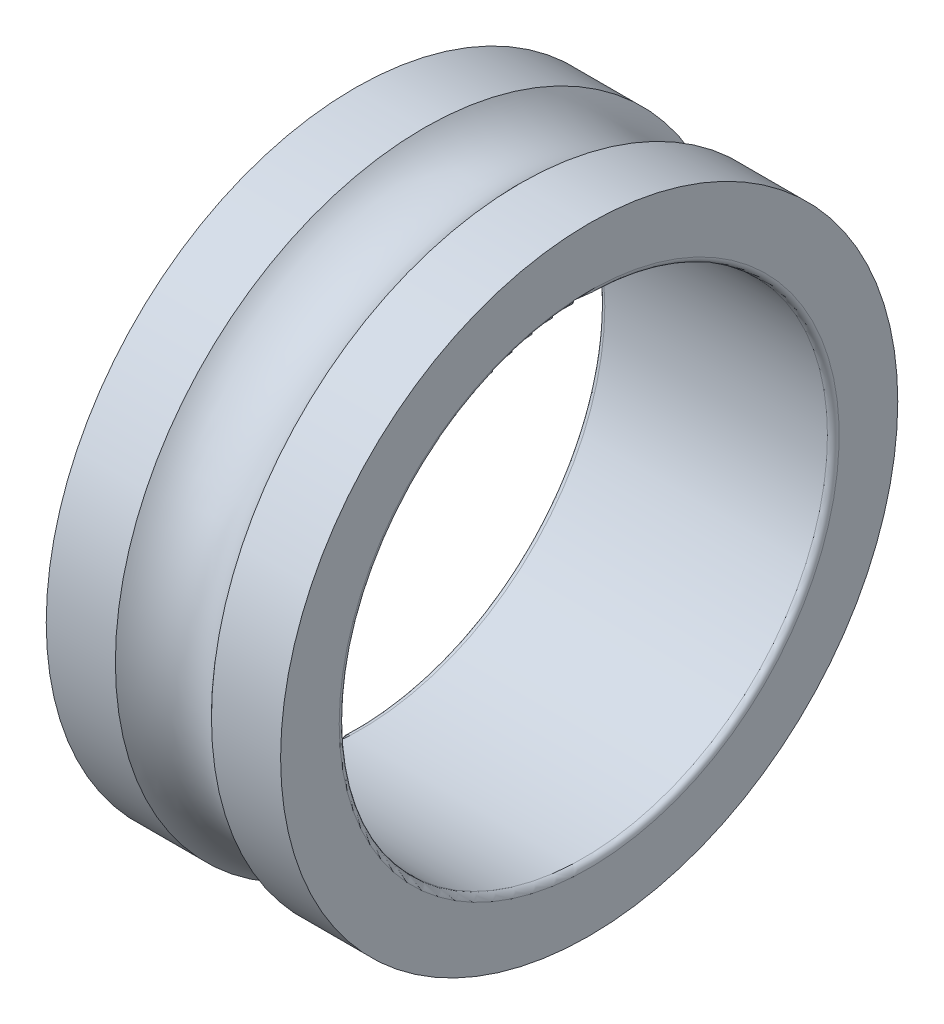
ISO-10303-21;
HEADER;
FILE_DESCRIPTION(('STEP AP214'),'2;1');
FILE_NAME('part.step','',(''),(''),'','','');
FILE_SCHEMA(('AUTOMOTIVE_DESIGN { 1 0 10303 214 1 1 1 1 }'));
ENDSEC;
DATA;
#1=APPLICATION_CONTEXT('core data for automotive mechanical design processes');
#2=APPLICATION_PROTOCOL_DEFINITION('international standard','automotive_design',2000,#1);
#3=PRODUCT_CONTEXT('',#1,'mechanical');
#4=PRODUCT('Part','Part','',(#3));
#5=PRODUCT_RELATED_PRODUCT_CATEGORY('part','',(#4));
#6=PRODUCT_DEFINITION_FORMATION('','',#4);
#7=PRODUCT_DEFINITION_CONTEXT('part definition',#1,'design');
#8=PRODUCT_DEFINITION('design','',#6,#7);
#9=PRODUCT_DEFINITION_SHAPE('','',#8);
#10=(LENGTH_UNIT() NAMED_UNIT(*) SI_UNIT(.MILLI.,.METRE.));
#11=(NAMED_UNIT(*) PLANE_ANGLE_UNIT() SI_UNIT($,.RADIAN.));
#12=(NAMED_UNIT(*) SI_UNIT($,.STERADIAN.) SOLID_ANGLE_UNIT());
#13=UNCERTAINTY_MEASURE_WITH_UNIT(LENGTH_MEASURE(1.E-05),#10,'distance_accuracy_value','');
#14=(GEOMETRIC_REPRESENTATION_CONTEXT(3) GLOBAL_UNCERTAINTY_ASSIGNED_CONTEXT((#13)) GLOBAL_UNIT_ASSIGNED_CONTEXT((#10,
#11,#12)) REPRESENTATION_CONTEXT('',''));
#15=CARTESIAN_POINT('',(0.,0.,0.));
#16=DIRECTION('',(0.,0.,1.));
#17=DIRECTION('',(1.,0.,0.));
#18=AXIS2_PLACEMENT_3D('',#15,#16,#17);
#19=CARTESIAN_POINT('',(0.300000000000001,0.,0.));
#20=DIRECTION('',(-1.,0.,0.));
#21=DIRECTION('',(0.,0.,1.));
#22=AXIS2_PLACEMENT_3D('',#19,#20,#21);
#23=TOROIDAL_SURFACE('',#22,12.8,0.3);
#24=CARTESIAN_POINT('',(0.300000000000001,0.,0.));
#25=DIRECTION('',(-1.,0.,0.));
#26=DIRECTION('',(0.,0.,1.));
#27=AXIS2_PLACEMENT_3D('',#24,#25,#26);
#28=CIRCLE('',#27,12.5);
#29=CARTESIAN_POINT('',(0.300000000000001,0.,12.5));
#30=VERTEX_POINT('',#29);
#31=EDGE_CURVE('E10',#30,#30,#28,.T.);
#32=ORIENTED_EDGE('',*,*,#31,.F.);
#33=EDGE_LOOP('',(#32));
#34=FACE_BOUND('',#33,.T.);
#35=CARTESIAN_POINT('',(0.,0.,0.));
#36=DIRECTION('',(-1.,0.,0.));
#37=DIRECTION('',(0.,0.,1.));
#38=AXIS2_PLACEMENT_3D('',#35,#36,#37);
#39=CIRCLE('',#38,12.8);
#40=CARTESIAN_POINT('',(0.,0.,12.8));
#41=VERTEX_POINT('',#40);
#42=EDGE_CURVE('E62',#41,#41,#39,.T.);
#43=ORIENTED_EDGE('',*,*,#42,.T.);
#44=EDGE_LOOP('',(#43));
#45=FACE_BOUND('',#44,.T.);
#46=ADVANCED_FACE('F34',(#34,#45),#23,.T.);
#47=CARTESIAN_POINT('',(0.,0.,0.));
#48=DIRECTION('',(-1.,0.,0.));
#49=DIRECTION('',(0.,0.,1.));
#50=AXIS2_PLACEMENT_3D('',#47,#48,#49);
#51=CYLINDRICAL_SURFACE('',#50,12.5);
#52=CARTESIAN_POINT('',(11.7,0.,0.));
#53=DIRECTION('',(-1.,0.,0.));
#54=DIRECTION('',(0.,0.,1.));
#55=AXIS2_PLACEMENT_3D('',#52,#53,#54);
#56=CIRCLE('',#55,12.5);
#57=CARTESIAN_POINT('',(11.7,0.,12.5));
#58=VERTEX_POINT('',#57);
#59=EDGE_CURVE('E40',#58,#58,#56,.T.);
#60=ORIENTED_EDGE('',*,*,#59,.F.);
#61=EDGE_LOOP('',(#60));
#62=FACE_BOUND('',#61,.T.);
#63=ORIENTED_EDGE('',*,*,#31,.T.);
#64=EDGE_LOOP('',(#63));
#65=FACE_BOUND('',#64,.T.);
#66=ADVANCED_FACE('F99',(#62,#65),#51,.F.);
#67=CARTESIAN_POINT('',(11.7,0.,0.));
#68=DIRECTION('',(-1.,0.,0.));
#69=DIRECTION('',(0.,0.,1.));
#70=AXIS2_PLACEMENT_3D('',#67,#68,#69);
#71=TOROIDAL_SURFACE('',#70,12.8,0.300000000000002);
#72=CARTESIAN_POINT('',(12.,0.,0.));
#73=DIRECTION('',(-1.,0.,0.));
#74=DIRECTION('',(0.,0.,1.));
#75=AXIS2_PLACEMENT_3D('',#72,#73,#74);
#76=CIRCLE('',#75,12.8);
#77=CARTESIAN_POINT('',(12.,0.,12.8));
#78=VERTEX_POINT('',#77);
#79=EDGE_CURVE('E44',#78,#78,#76,.T.);
#80=ORIENTED_EDGE('',*,*,#79,.F.);
#81=EDGE_LOOP('',(#80));
#82=FACE_BOUND('',#81,.T.);
#83=ORIENTED_EDGE('',*,*,#59,.T.);
#84=EDGE_LOOP('',(#83));
#85=FACE_BOUND('',#84,.T.);
#86=ADVANCED_FACE('F94',(#82,#85),#71,.T.);
#87=CARTESIAN_POINT('',(12.,0.,-15.8));
#88=DIRECTION('',(-1.,0.,0.));
#89=DIRECTION('',(0.,0.,1.));
#90=AXIS2_PLACEMENT_3D('',#87,#88,#89);
#91=PLANE('',#90);
#92=CARTESIAN_POINT('',(12.,0.,0.));
#93=DIRECTION('',(-1.,0.,0.));
#94=DIRECTION('',(0.,0.,1.));
#95=AXIS2_PLACEMENT_3D('',#92,#93,#94);
#96=CIRCLE('',#95,15.8);
#97=CARTESIAN_POINT('',(12.,0.,15.8));
#98=VERTEX_POINT('',#97);
#99=EDGE_CURVE('E48',#98,#98,#96,.T.);
#100=ORIENTED_EDGE('',*,*,#99,.F.);
#101=EDGE_LOOP('',(#100));
#102=FACE_BOUND('',#101,.T.);
#103=ORIENTED_EDGE('',*,*,#79,.T.);
#104=EDGE_LOOP('',(#103));
#105=FACE_BOUND('',#104,.T.);
#106=ADVANCED_FACE('F88',(#102,#105),#91,.F.);
#107=CARTESIAN_POINT('',(0.,0.,0.));
#108=DIRECTION('',(-1.,0.,0.));
#109=DIRECTION('',(0.,0.,1.));
#110=AXIS2_PLACEMENT_3D('',#107,#108,#109);
#111=CYLINDRICAL_SURFACE('',#110,15.8);
#112=CARTESIAN_POINT('',(8.45967477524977,0.,0.));
#113=DIRECTION('',(-1.,0.,0.));
#114=DIRECTION('',(0.,0.,1.));
#115=AXIS2_PLACEMENT_3D('',#112,#113,#114);
#116=CIRCLE('',#115,15.8);
#117=CARTESIAN_POINT('',(8.45967477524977,0.,15.8));
#118=VERTEX_POINT('',#117);
#119=EDGE_CURVE('E53',#118,#118,#116,.T.);
#120=ORIENTED_EDGE('',*,*,#119,.F.);
#121=EDGE_LOOP('',(#120));
#122=FACE_BOUND('',#121,.T.);
#123=ORIENTED_EDGE('',*,*,#99,.T.);
#124=EDGE_LOOP('',(#123));
#125=FACE_BOUND('',#124,.T.);
#126=ADVANCED_FACE('F82',(#122,#125),#111,.T.);
#127=CARTESIAN_POINT('',(6.,0.,0.));
#128=DIRECTION('',(-1.,0.,0.));
#129=DIRECTION('',(0.,0.,1.));
#130=AXIS2_PLACEMENT_3D('',#127,#128,#129);
#131=TOROIDAL_SURFACE('',#130,18.,3.3);
#132=CARTESIAN_POINT('',(3.54032522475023,0.,0.));
#133=DIRECTION('',(-1.,0.,0.));
#134=DIRECTION('',(0.,0.,1.));
#135=AXIS2_PLACEMENT_3D('',#132,#133,#134);
#136=CIRCLE('',#135,15.8);
#137=CARTESIAN_POINT('',(3.54032522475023,0.,15.8));
#138=VERTEX_POINT('',#137);
#139=EDGE_CURVE('E56',#138,#138,#136,.T.);
#140=ORIENTED_EDGE('',*,*,#139,.F.);
#141=EDGE_LOOP('',(#140));
#142=FACE_BOUND('',#141,.T.);
#143=ORIENTED_EDGE('',*,*,#119,.T.);
#144=EDGE_LOOP('',(#143));
#145=FACE_BOUND('',#144,.T.);
#146=ADVANCED_FACE('F76',(#142,#145),#131,.F.);
#147=CARTESIAN_POINT('',(0.,0.,0.));
#148=DIRECTION('',(-1.,0.,0.));
#149=DIRECTION('',(0.,0.,1.));
#150=AXIS2_PLACEMENT_3D('',#147,#148,#149);
#151=CYLINDRICAL_SURFACE('',#150,15.8);
#152=CARTESIAN_POINT('',(0.,0.,0.));
#153=DIRECTION('',(-1.,0.,0.));
#154=DIRECTION('',(0.,0.,1.));
#155=AXIS2_PLACEMENT_3D('',#152,#153,#154);
#156=CIRCLE('',#155,15.8);
#157=CARTESIAN_POINT('',(0.,0.,15.8));
#158=VERTEX_POINT('',#157);
#159=EDGE_CURVE('E59',#158,#158,#156,.T.);
#160=ORIENTED_EDGE('',*,*,#159,.F.);
#161=EDGE_LOOP('',(#160));
#162=FACE_BOUND('',#161,.T.);
#163=ORIENTED_EDGE('',*,*,#139,.T.);
#164=EDGE_LOOP('',(#163));
#165=FACE_BOUND('',#164,.T.);
#166=ADVANCED_FACE('F70',(#162,#165),#151,.T.);
#167=CARTESIAN_POINT('',(0.,0.,-15.8));
#168=DIRECTION('',(1.,0.,0.));
#169=DIRECTION('',(0.,0.,-1.));
#170=AXIS2_PLACEMENT_3D('',#167,#168,#169);
#171=PLANE('',#170);
#172=ORIENTED_EDGE('',*,*,#42,.F.);
#173=EDGE_LOOP('',(#172));
#174=FACE_BOUND('',#173,.T.);
#175=ORIENTED_EDGE('',*,*,#159,.T.);
#176=EDGE_LOOP('',(#175));
#177=FACE_BOUND('',#176,.T.);
#178=ADVANCED_FACE('F67',(#174,#177),#171,.F.);
#179=CLOSED_SHELL('',(#46,#66,#86,#106,#126,#146,#166,#178));
#180=MANIFOLD_SOLID_BREP('B2',#179);
#181=ADVANCED_BREP_SHAPE_REPRESENTATION('',(#18,#180),#14);
#182=SHAPE_DEFINITION_REPRESENTATION(#9,#181);
ENDSEC;
END-ISO-10303-21;
